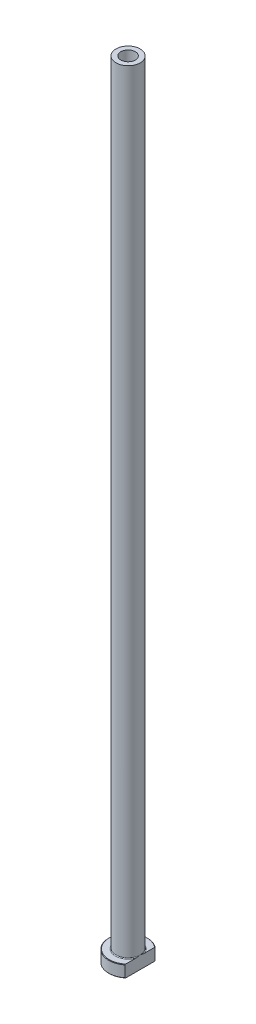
from build123d import *

# Parameters (mm, degrees)
FILLET1_R          = 0.3
CHAMFER1_SIZE      = 0.2
CUT_EXTRUDE1_DEPTH = 326.196863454
CHAMFER2_SIZE      = 0.5


with BuildPart() as part:
    # Sketch1 → Revolve1 (revolve)
    with BuildSketch(Plane.XY, mode=Mode.PRIVATE) as revolve1_sk:
        Polygon((-3, 325), (-5, 325), (-5, 5), (-8, 5), (-8, 0), (-3.25, 0), (-3.25, 268), (-3, 280), align=None)
    revolve(revolve1_sk.sketch.rotate(Axis((0, 92.187680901, 0), (0, -1, 0)), 270), axis=Axis((0, 92.187680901, 0), (0, -1, 0)))

    # Fillet1
    fillet1_edges = [part.edges().sort_by_distance(p)[0] for p in [
        (0, 5, -5),
    ]]
    fillet(fillet1_edges, radius=FILLET1_R)

    # Chamfer1
    chamfer1_edges = [part.edges().sort_by_distance(p)[0] for p in [
        (0, 0, -8),
        (0, 5, -8),
    ]]
    chamfer(chamfer1_edges, length=CHAMFER1_SIZE)

    # Sketch2 → Cut-Extrude1 (cut, through all)
    with BuildSketch(Plane.XZ):
        with BuildLine():
            Line((5, 6.244997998), (5, -6.244997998))
            ThreePointArc((5, -6.244997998), (8, 0), (5, 6.244997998))
        make_face()
    extrude(amount=-CUT_EXTRUDE1_DEPTH, mode=Mode.SUBTRACT)

    # Chamfer2
    chamfer2_edges = [part.edges().sort_by_distance(p)[0] for p in [
        (0, 0, -3.25),
    ]]
    chamfer(chamfer2_edges, length=CHAMFER2_SIZE)


solid = part.part
